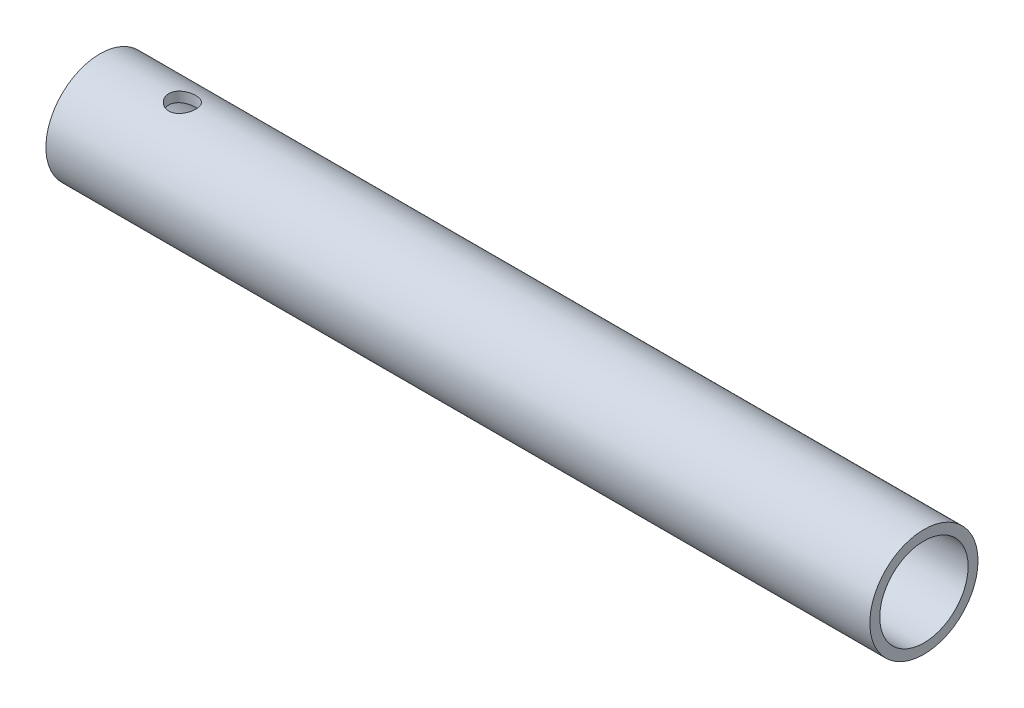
from build123d import *

# Parameters (mm, degrees)
SKETCH1_R           = 16.66875
SKETCH1_R_2         = 13.62075
EXTRUDE1_DEPTH      = 127
EXTRUDE2_DEPTH      = 130.16924732
EXTRUDE2_DEPTH_BACK = 130.16924732
SKETCH2_R           = 4.1656


with BuildPart() as part:
    # Sketch1 → Extrude1 (new, symmetric)
    with BuildSketch(Plane(origin=(0, 0, 0), x_dir=(0, 0, -1), z_dir=(1, 0, 0))):
        Circle(SKETCH1_R)
        Circle(SKETCH1_R_2, mode=Mode.SUBTRACT)
    extrude(amount=EXTRUDE1_DEPTH, both=True)

    # Sketch2 → Extrude2 (cut, two sides: drawn at the far end of the back side and taken through both)
    with BuildSketch(Plane(origin=(0, 0, 0), x_dir=(1, 0, 0), z_dir=(0, 1, 0)).offset(-EXTRUDE2_DEPTH_BACK)):
        with Locations(Location((-101.6, 0, 0), (0, 0, 270))):
            Circle(SKETCH2_R)
    extrude(amount=EXTRUDE2_DEPTH + EXTRUDE2_DEPTH_BACK, mode=Mode.SUBTRACT)


solid = part.part
